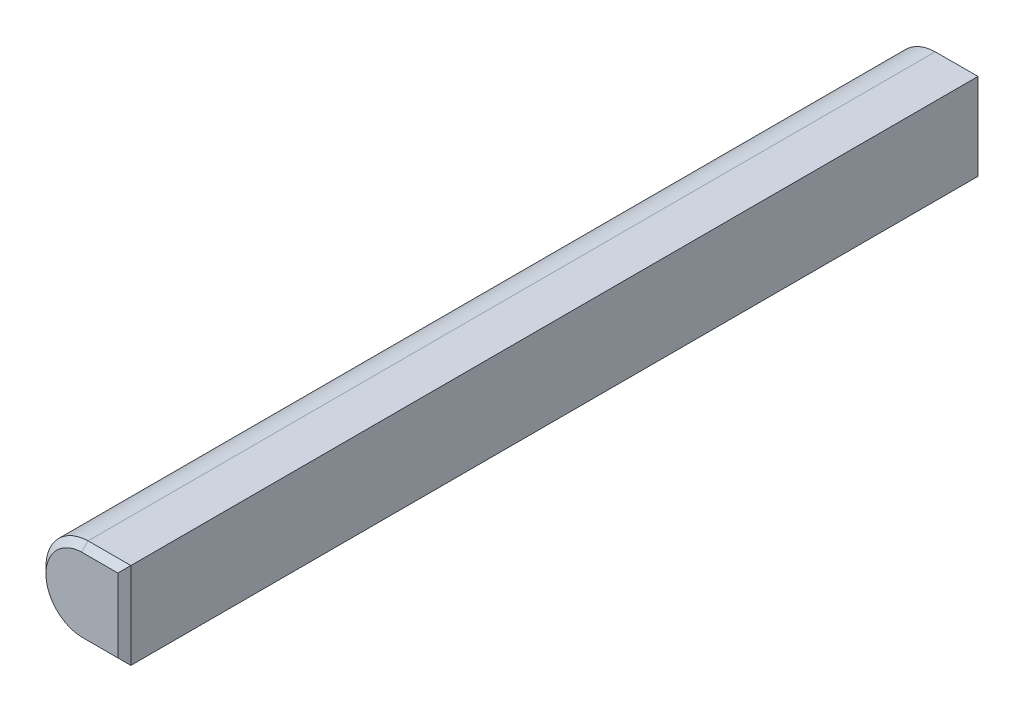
from build123d import *

# Parameters (mm, degrees)
BOSS_EXTRUDE1_DEPTH = 79.5
CHAMFER1_SIZE       = 0.6


with BuildPart() as part:
    # Sketch1 → Boss-Extrude1 (new body)
    with BuildSketch(Plane.XY):
        with BuildLine():
            Line((3.85, -3.998733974), (-0.100631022, -3.998733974))
            ThreePointArc((-0.100631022, -3.998733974), (-4, 0), (-0.100631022, 3.998733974))
            Line((-0.100631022, 3.998733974), (3.85, 3.998733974))
            Line((3.85, 3.998733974), (3.85, -3.998733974))
        make_face()
    extrude(amount=BOSS_EXTRUDE1_DEPTH)

    # Chamfer1
    chamfer1_edges = [part.edges().sort_by_distance(p)[0] for p in [
        (-4, 0, 79.5),
        (1.874684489, -3.998733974, 79.5),
        (3.85, 0, 79.5),
        (1.874684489, -3.998733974, 0),
        (-4, 0, 0),
        (1.874684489, 3.998733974, 0),
        (3.85, 0, 0),
        (1.874684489, 3.998733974, 79.5),
    ]]
    chamfer(chamfer1_edges, length=CHAMFER1_SIZE)


solid = part.part
